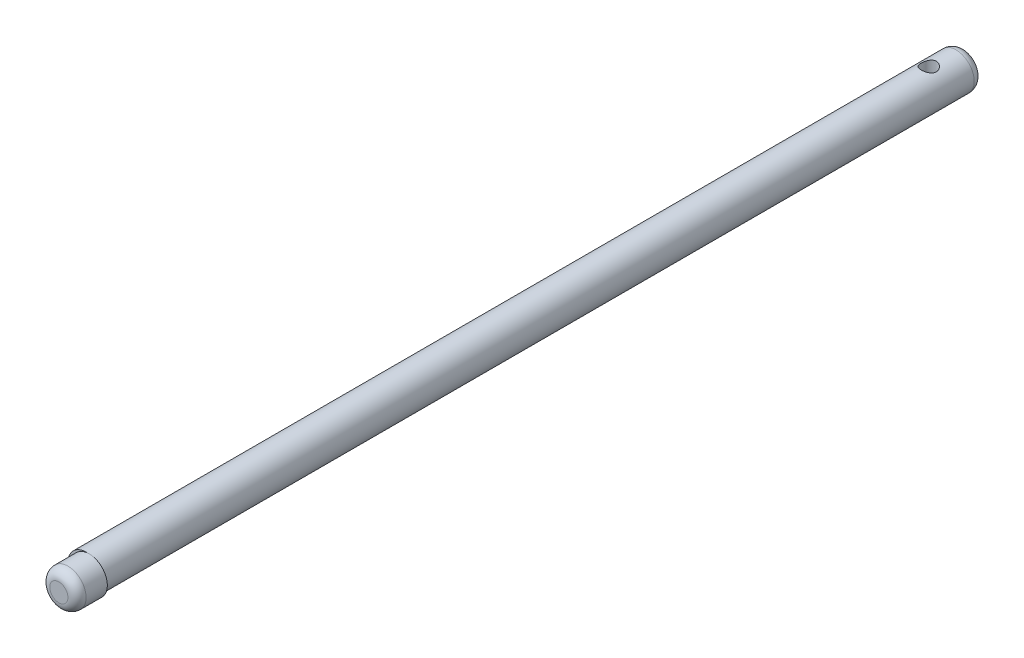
from build123d import *

# Parameters (mm, degrees)
ESQUISSE1_R                  = 3
BOSS_EXTRU_1_DEPTH           = 145
ENL_V_MAT_EXTRU_1_DEPTH      = 146.062055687
ENL_V_MAT_EXTRU_1_DEPTH_BACK = 146.062055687
ESQUISSE2_R                  = 1.25
ESQUISSE3_R                  = 3
BOSS_EXTRU_2_DEPTH           = 5
CONG_1_R                     = 1.5


with BuildPart() as part:
    # Esquisse1 → Boss.-Extru.1 (new body)
    with BuildSketch(Plane.XY):
        Circle(ESQUISSE1_R)
    extrude(amount=BOSS_EXTRU_1_DEPTH)

    # Esquisse2 → Enl_v. mat.-Extru.1 (cut, two sides: drawn at the far end of the back side and taken through both)
    with BuildSketch(Plane(origin=(0, 0, 0), x_dir=(1, 0, 0), z_dir=(0, 1, 0)).offset(-ENL_V_MAT_EXTRU_1_DEPTH_BACK)):
        with Locations(Location((0, -6, 0), (0, 0, 270))):
            Circle(ESQUISSE2_R)
    extrude(amount=ENL_V_MAT_EXTRU_1_DEPTH + ENL_V_MAT_EXTRU_1_DEPTH_BACK, mode=Mode.SUBTRACT)

    # Esquisse3 → Boss.-Extru.2 (add)
    with BuildSketch(Plane.XY.offset(145)):
        with Locations(Location((0.5, 0, 0), (0, 0, 265.219808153))):
            Circle(ESQUISSE3_R)
    extrude(amount=BOSS_EXTRU_2_DEPTH)

    # Cong_1
    cong_1_edges = [part.edges().sort_by_distance(p)[0] for p in [
        (0.75, 2.989565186, 150),
        (-3, 0, 0),
    ]]
    fillet(cong_1_edges, radius=CONG_1_R)


solid = part.part
